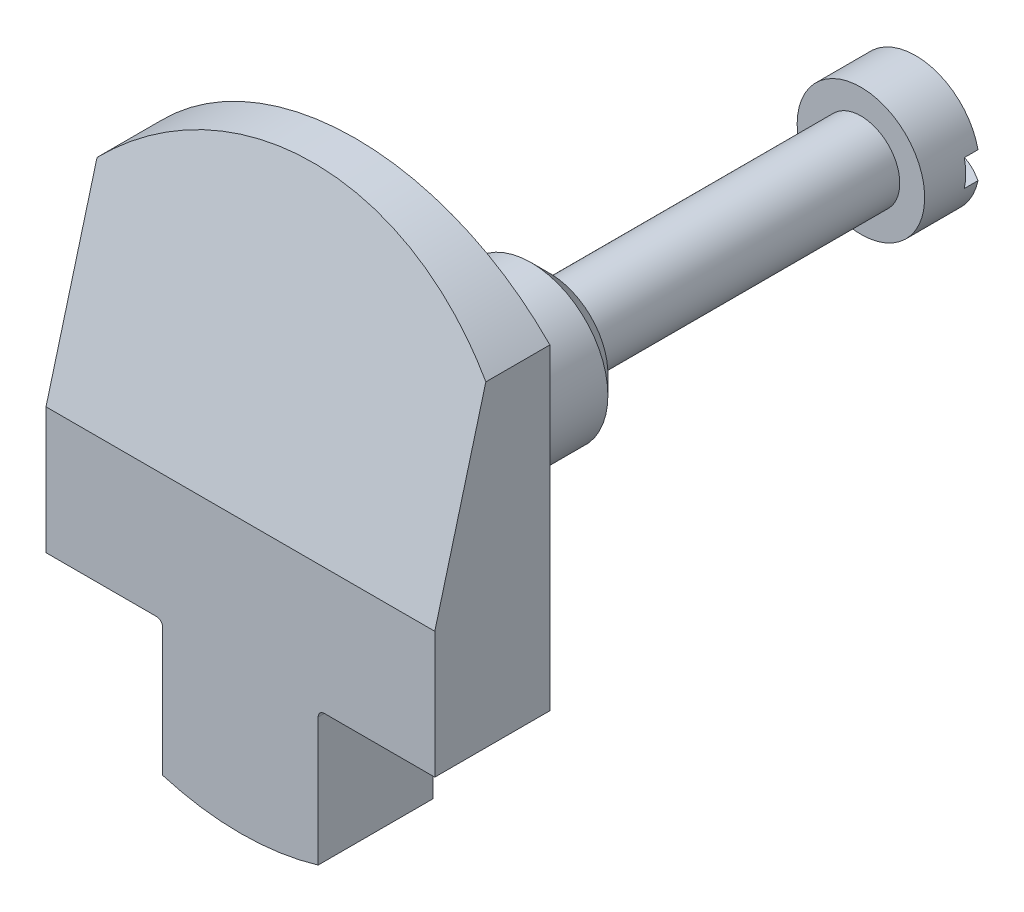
ISO-10303-21;
HEADER;
FILE_DESCRIPTION(('STEP AP214'),'2;1');
FILE_NAME('part.step','',(''),(''),'','','');
FILE_SCHEMA(('AUTOMOTIVE_DESIGN { 1 0 10303 214 1 1 1 1 }'));
ENDSEC;
DATA;
#1=APPLICATION_CONTEXT('core data for automotive mechanical design processes');
#2=APPLICATION_PROTOCOL_DEFINITION('international standard','automotive_design',2000,#1);
#3=PRODUCT_CONTEXT('',#1,'mechanical');
#4=PRODUCT('Part','Part','',(#3));
#5=PRODUCT_RELATED_PRODUCT_CATEGORY('part','',(#4));
#6=PRODUCT_DEFINITION_FORMATION('','',#4);
#7=PRODUCT_DEFINITION_CONTEXT('part definition',#1,'design');
#8=PRODUCT_DEFINITION('design','',#6,#7);
#9=PRODUCT_DEFINITION_SHAPE('','',#8);
#10=(LENGTH_UNIT() NAMED_UNIT(*) SI_UNIT(.MILLI.,.METRE.));
#11=(NAMED_UNIT(*) PLANE_ANGLE_UNIT() SI_UNIT($,.RADIAN.));
#12=(NAMED_UNIT(*) SI_UNIT($,.STERADIAN.) SOLID_ANGLE_UNIT());
#13=UNCERTAINTY_MEASURE_WITH_UNIT(LENGTH_MEASURE(1.E-05),#10,'distance_accuracy_value','');
#14=(GEOMETRIC_REPRESENTATION_CONTEXT(3) GLOBAL_UNCERTAINTY_ASSIGNED_CONTEXT((#13)) GLOBAL_UNIT_ASSIGNED_CONTEXT((#10,
#11,#12)) REPRESENTATION_CONTEXT('',''));
#15=CARTESIAN_POINT('',(0.,0.,0.));
#16=DIRECTION('',(0.,0.,1.));
#17=DIRECTION('',(1.,0.,0.));
#18=AXIS2_PLACEMENT_3D('',#15,#16,#17);
#19=CARTESIAN_POINT('',(0.,0.,0.));
#20=DIRECTION('',(0.,0.,1.));
#21=DIRECTION('',(1.,0.,0.));
#22=AXIS2_PLACEMENT_3D('',#19,#20,#21);
#23=PLANE('',#22);
#24=CARTESIAN_POINT('',(0.,0.,0.));
#25=DIRECTION('',(0.,0.,1.));
#26=DIRECTION('',(1.,0.,0.));
#27=AXIS2_PLACEMENT_3D('',#24,#25,#26);
#28=CIRCLE('',#27,3.38455);
#29=CARTESIAN_POINT('',(3.38455,0.,0.));
#30=VERTEX_POINT('',#29);
#31=EDGE_CURVE('E162',#30,#30,#28,.T.);
#32=ORIENTED_EDGE('',*,*,#31,.T.);
#33=EDGE_LOOP('',(#32));
#34=FACE_BOUND('',#33,.T.);
#35=CARTESIAN_POINT('',(0.,0.,0.));
#36=DIRECTION('',(0.,0.,1.));
#37=DIRECTION('',(1.,0.,0.));
#38=AXIS2_PLACEMENT_3D('',#35,#36,#37);
#39=CIRCLE('',#38,11.1125);
#40=CARTESIAN_POINT('',(-3.175,-10.6492737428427,0.));
#41=VERTEX_POINT('',#40);
#42=CARTESIAN_POINT('',(3.175,-10.6492737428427,0.));
#43=VERTEX_POINT('',#42);
#44=EDGE_CURVE('E497',#41,#43,#39,.T.);
#45=ORIENTED_EDGE('',*,*,#44,.F.);
#46=DIRECTION('',(0.,-1.,0.));
#47=VECTOR('',#46,1.);
#48=CARTESIAN_POINT('',(-3.175,-5.159375,0.));
#49=LINE('',#48,#47);
#50=CARTESIAN_POINT('',(-3.175,-5.413375,0.));
#51=VERTEX_POINT('',#50);
#52=EDGE_CURVE('E489',#51,#41,#49,.T.);
#53=ORIENTED_EDGE('',*,*,#52,.F.);
#54=CARTESIAN_POINT('',(-3.429,-5.413375,0.));
#55=DIRECTION('',(0.,0.,1.));
#56=DIRECTION('',(1.,0.,0.));
#57=AXIS2_PLACEMENT_3D('',#54,#55,#56);
#58=CIRCLE('',#57,0.254);
#59=CARTESIAN_POINT('',(-3.429,-5.159375,0.));
#60=VERTEX_POINT('',#59);
#61=EDGE_CURVE('E165',#51,#60,#58,.T.);
#62=ORIENTED_EDGE('',*,*,#61,.T.);
#63=DIRECTION('',(1.,0.,0.));
#64=VECTOR('',#63,1.);
#65=CARTESIAN_POINT('',(-3.175,-5.159375,0.));
#66=LINE('',#65,#64);
#67=CARTESIAN_POINT('',(-7.9375,-5.159375,0.));
#68=VERTEX_POINT('',#67);
#69=EDGE_CURVE('E499',#68,#60,#66,.T.);
#70=ORIENTED_EDGE('',*,*,#69,.F.);
#71=DIRECTION('',(0.,-1.,0.));
#72=VECTOR('',#71,1.);
#73=CARTESIAN_POINT('',(-7.9375,-5.159375,0.));
#74=LINE('',#73,#72);
#75=CARTESIAN_POINT('',(-7.9375,7.77712993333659,0.));
#76=VERTEX_POINT('',#75);
#77=EDGE_CURVE('E502',#76,#68,#74,.T.);
#78=ORIENTED_EDGE('',*,*,#77,.F.);
#79=CARTESIAN_POINT('',(0.,0.,0.));
#80=DIRECTION('',(0.,0.,1.));
#81=DIRECTION('',(1.,0.,0.));
#82=AXIS2_PLACEMENT_3D('',#79,#80,#81);
#83=CIRCLE('',#82,11.1125);
#84=CARTESIAN_POINT('',(7.9375,7.77712993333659,0.));
#85=VERTEX_POINT('',#84);
#86=EDGE_CURVE('E464',#85,#76,#83,.T.);
#87=ORIENTED_EDGE('',*,*,#86,.F.);
#88=DIRECTION('',(0.,1.,0.));
#89=VECTOR('',#88,1.);
#90=CARTESIAN_POINT('',(7.9375,-5.159375,0.));
#91=LINE('',#90,#89);
#92=CARTESIAN_POINT('',(7.9375,-5.159375,0.));
#93=VERTEX_POINT('',#92);
#94=EDGE_CURVE('E517',#93,#85,#91,.T.);
#95=ORIENTED_EDGE('',*,*,#94,.F.);
#96=DIRECTION('',(1.,0.,0.));
#97=VECTOR('',#96,1.);
#98=CARTESIAN_POINT('',(7.9375,-5.159375,0.));
#99=LINE('',#98,#97);
#100=CARTESIAN_POINT('',(3.429,-5.159375,0.));
#101=VERTEX_POINT('',#100);
#102=EDGE_CURVE('E522',#101,#93,#99,.T.);
#103=ORIENTED_EDGE('',*,*,#102,.F.);
#104=CARTESIAN_POINT('',(3.429,-5.413375,0.));
#105=DIRECTION('',(0.,0.,1.));
#106=DIRECTION('',(1.,0.,0.));
#107=AXIS2_PLACEMENT_3D('',#104,#105,#106);
#108=CIRCLE('',#107,0.254);
#109=CARTESIAN_POINT('',(3.175,-5.413375,0.));
#110=VERTEX_POINT('',#109);
#111=EDGE_CURVE('E139',#101,#110,#108,.T.);
#112=ORIENTED_EDGE('',*,*,#111,.T.);
#113=DIRECTION('',(0.,1.,0.));
#114=VECTOR('',#113,1.);
#115=CARTESIAN_POINT('',(3.175,-5.159375,0.));
#116=LINE('',#115,#114);
#117=EDGE_CURVE('E524',#43,#110,#116,.T.);
#118=ORIENTED_EDGE('',*,*,#117,.F.);
#119=EDGE_LOOP('',(#45,#53,#62,#70,#78,#87,#95,#103,#112,#118));
#120=FACE_BOUND('',#119,.T.);
#121=ADVANCED_FACE('F14',(#34,#120),#23,.F.);
#122=CARTESIAN_POINT('',(0.,0.,4.699));
#123=DIRECTION('',(0.,0.,-1.));
#124=DIRECTION('',(-1.,0.,0.));
#125=AXIS2_PLACEMENT_3D('',#122,#123,#124);
#126=CYLINDRICAL_SURFACE('',#125,11.1125);
#127=ORIENTED_EDGE('',*,*,#44,.T.);
#128=DIRECTION('',(0.,0.,-1.));
#129=VECTOR('',#128,1.);
#130=CARTESIAN_POINT('',(3.175,-10.6492737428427,4.699));
#131=LINE('',#130,#129);
#132=CARTESIAN_POINT('',(3.175,-10.6492737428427,4.699));
#133=VERTEX_POINT('',#132);
#134=EDGE_CURVE('E476',#133,#43,#131,.T.);
#135=ORIENTED_EDGE('',*,*,#134,.F.);
#136=CARTESIAN_POINT('',(0.,0.,4.699));
#137=DIRECTION('',(0.,0.,1.));
#138=DIRECTION('',(1.,0.,0.));
#139=AXIS2_PLACEMENT_3D('',#136,#137,#138);
#140=CIRCLE('',#139,11.1125);
#141=CARTESIAN_POINT('',(-3.175,-10.6492737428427,4.699));
#142=VERTEX_POINT('',#141);
#143=EDGE_CURVE('E498',#142,#133,#140,.T.);
#144=ORIENTED_EDGE('',*,*,#143,.F.);
#145=DIRECTION('',(0.,0.,-1.));
#146=VECTOR('',#145,1.);
#147=CARTESIAN_POINT('',(-3.175,-10.6492737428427,4.699));
#148=LINE('',#147,#146);
#149=EDGE_CURVE('E471',#142,#41,#148,.T.);
#150=ORIENTED_EDGE('',*,*,#149,.T.);
#151=EDGE_LOOP('',(#127,#135,#144,#150));
#152=FACE_BOUND('',#151,.T.);
#153=ADVANCED_FACE('F225',(#152),#126,.T.);
#154=CARTESIAN_POINT('',(3.175,-5.159375,4.699));
#155=DIRECTION('',(-1.,0.,0.));
#156=DIRECTION('',(0.,-1.,0.));
#157=AXIS2_PLACEMENT_3D('',#154,#155,#156);
#158=PLANE('',#157);
#159=ORIENTED_EDGE('',*,*,#117,.T.);
#160=DIRECTION('',(0.,0.,-1.));
#161=VECTOR('',#160,1.);
#162=CARTESIAN_POINT('',(3.175,-5.413375,4.699));
#163=LINE('',#162,#161);
#164=CARTESIAN_POINT('',(3.175,-5.413375,4.699));
#165=VERTEX_POINT('',#164);
#166=EDGE_CURVE('E33',#110,#165,#163,.F.);
#167=ORIENTED_EDGE('',*,*,#166,.T.);
#168=DIRECTION('',(0.,1.,0.));
#169=VECTOR('',#168,1.);
#170=CARTESIAN_POINT('',(3.175,-5.159375,4.699));
#171=LINE('',#170,#169);
#172=EDGE_CURVE('E136',#133,#165,#171,.T.);
#173=ORIENTED_EDGE('',*,*,#172,.F.);
#174=ORIENTED_EDGE('',*,*,#134,.T.);
#175=EDGE_LOOP('',(#159,#167,#173,#174));
#176=FACE_BOUND('',#175,.T.);
#177=ADVANCED_FACE('F232',(#176),#158,.F.);
#178=CARTESIAN_POINT('',(7.9375,-5.159375,4.699));
#179=DIRECTION('',(0.,1.,0.));
#180=DIRECTION('',(0.,0.,1.));
#181=AXIS2_PLACEMENT_3D('',#178,#179,#180);
#182=PLANE('',#181);
#183=DIRECTION('',(1.,0.,0.));
#184=VECTOR('',#183,1.);
#185=CARTESIAN_POINT('',(7.9375,-5.159375,4.699));
#186=LINE('',#185,#184);
#187=CARTESIAN_POINT('',(3.429,-5.159375,4.699));
#188=VERTEX_POINT('',#187);
#189=CARTESIAN_POINT('',(7.9375,-5.159375,4.699));
#190=VERTEX_POINT('',#189);
#191=EDGE_CURVE('E133',#188,#190,#186,.T.);
#192=ORIENTED_EDGE('',*,*,#191,.F.);
#193=DIRECTION('',(0.,0.,-1.));
#194=VECTOR('',#193,1.);
#195=CARTESIAN_POINT('',(3.429,-5.159375,0.));
#196=LINE('',#195,#194);
#197=EDGE_CURVE('E144',#188,#101,#196,.T.);
#198=ORIENTED_EDGE('',*,*,#197,.T.);
#199=ORIENTED_EDGE('',*,*,#102,.T.);
#200=DIRECTION('',(0.,0.,-1.));
#201=VECTOR('',#200,1.);
#202=CARTESIAN_POINT('',(7.9375,-5.159375,4.699));
#203=LINE('',#202,#201);
#204=EDGE_CURVE('E147',#190,#93,#203,.T.);
#205=ORIENTED_EDGE('',*,*,#204,.F.);
#206=EDGE_LOOP('',(#192,#198,#199,#205));
#207=FACE_BOUND('',#206,.T.);
#208=ADVANCED_FACE('F143',(#207),#182,.F.);
#209=CARTESIAN_POINT('',(7.9375,-5.159375,4.699));
#210=DIRECTION('',(-1.,0.,0.));
#211=DIRECTION('',(0.,-1.,0.));
#212=AXIS2_PLACEMENT_3D('',#209,#210,#211);
#213=PLANE('',#212);
#214=DIRECTION('',(0.,0.,-1.));
#215=VECTOR('',#214,1.);
#216=CARTESIAN_POINT('',(7.9375,7.77712993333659,4.699));
#217=LINE('',#216,#215);
#218=CARTESIAN_POINT('',(7.9375,7.77712993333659,2.61512431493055));
#219=VERTEX_POINT('',#218);
#220=EDGE_CURVE('E466',#219,#85,#217,.T.);
#221=ORIENTED_EDGE('',*,*,#220,.F.);
#222=DIRECTION('',(0.,-0.965925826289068,0.258819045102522));
#223=VECTOR('',#222,1.);
#224=CARTESIAN_POINT('',(7.9375,-4.81376240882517,5.98884375));
#225=LINE('',#224,#223);
#226=CARTESIAN_POINT('',(7.9375,0.,4.699));
#227=VERTEX_POINT('',#226);
#228=EDGE_CURVE('E453',#219,#227,#225,.T.);
#229=ORIENTED_EDGE('',*,*,#228,.T.);
#230=DIRECTION('',(0.,1.,0.));
#231=VECTOR('',#230,1.);
#232=CARTESIAN_POINT('',(7.9375,-5.159375,4.699));
#233=LINE('',#232,#231);
#234=EDGE_CURVE('E149',#190,#227,#233,.T.);
#235=ORIENTED_EDGE('',*,*,#234,.F.);
#236=ORIENTED_EDGE('',*,*,#204,.T.);
#237=ORIENTED_EDGE('',*,*,#94,.T.);
#238=EDGE_LOOP('',(#221,#229,#235,#236,#237));
#239=FACE_BOUND('',#238,.T.);
#240=ADVANCED_FACE('F257',(#239),#213,.F.);
#241=CARTESIAN_POINT('',(0.,0.,4.699));
#242=DIRECTION('',(0.,0.,-1.));
#243=DIRECTION('',(-1.,0.,0.));
#244=AXIS2_PLACEMENT_3D('',#241,#242,#243);
#245=CYLINDRICAL_SURFACE('',#244,11.1125);
#246=DIRECTION('',(0.,0.,-1.));
#247=VECTOR('',#246,1.);
#248=CARTESIAN_POINT('',(-7.9375,7.77712993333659,4.699));
#249=LINE('',#248,#247);
#250=CARTESIAN_POINT('',(-7.9375,7.77712993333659,2.61512431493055));
#251=VERTEX_POINT('',#250);
#252=EDGE_CURVE('E458',#251,#76,#249,.T.);
#253=ORIENTED_EDGE('',*,*,#252,.F.);
#254=CARTESIAN_POINT('',(0.,0.,4.699));
#255=DIRECTION('',(0.,-0.258819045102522,-0.965925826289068));
#256=DIRECTION('',(0.,0.965925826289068,-0.258819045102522));
#257=AXIS2_PLACEMENT_3D('',#254,#255,#256);
#258=ELLIPSE('',#257,11.504506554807,11.1125);
#259=EDGE_CURVE('E451',#251,#219,#258,.T.);
#260=ORIENTED_EDGE('',*,*,#259,.T.);
#261=ORIENTED_EDGE('',*,*,#220,.T.);
#262=ORIENTED_EDGE('',*,*,#86,.T.);
#263=EDGE_LOOP('',(#253,#260,#261,#262));
#264=FACE_BOUND('',#263,.T.);
#265=ADVANCED_FACE('F253',(#264),#245,.T.);
#266=CARTESIAN_POINT('',(-7.9375,-5.159375,4.699));
#267=DIRECTION('',(1.,0.,0.));
#268=DIRECTION('',(0.,1.,0.));
#269=AXIS2_PLACEMENT_3D('',#266,#267,#268);
#270=PLANE('',#269);
#271=DIRECTION('',(0.,-1.,0.));
#272=VECTOR('',#271,1.);
#273=CARTESIAN_POINT('',(-7.9375,-5.159375,4.699));
#274=LINE('',#273,#272);
#275=CARTESIAN_POINT('',(-7.9375,0.,4.699));
#276=VERTEX_POINT('',#275);
#277=CARTESIAN_POINT('',(-7.9375,-5.159375,4.699));
#278=VERTEX_POINT('',#277);
#279=EDGE_CURVE('E461',#276,#278,#274,.T.);
#280=ORIENTED_EDGE('',*,*,#279,.F.);
#281=DIRECTION('',(0.,0.965925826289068,-0.258819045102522));
#282=VECTOR('',#281,1.);
#283=CARTESIAN_POINT('',(-7.9375,-4.81376240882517,5.98884375));
#284=LINE('',#283,#282);
#285=EDGE_CURVE('E200',#276,#251,#284,.T.);
#286=ORIENTED_EDGE('',*,*,#285,.T.);
#287=ORIENTED_EDGE('',*,*,#252,.T.);
#288=ORIENTED_EDGE('',*,*,#77,.T.);
#289=DIRECTION('',(0.,0.,-1.));
#290=VECTOR('',#289,1.);
#291=CARTESIAN_POINT('',(-7.9375,-5.159375,4.699));
#292=LINE('',#291,#290);
#293=EDGE_CURVE('E467',#278,#68,#292,.T.);
#294=ORIENTED_EDGE('',*,*,#293,.F.);
#295=EDGE_LOOP('',(#280,#286,#287,#288,#294));
#296=FACE_BOUND('',#295,.T.);
#297=ADVANCED_FACE('F249',(#296),#270,.F.);
#298=CARTESIAN_POINT('',(-3.175,-5.159375,4.699));
#299=DIRECTION('',(0.,1.,0.));
#300=DIRECTION('',(0.,0.,1.));
#301=AXIS2_PLACEMENT_3D('',#298,#299,#300);
#302=PLANE('',#301);
#303=ORIENTED_EDGE('',*,*,#69,.T.);
#304=DIRECTION('',(0.,0.,-1.));
#305=VECTOR('',#304,1.);
#306=CARTESIAN_POINT('',(-3.429,-5.159375,4.699));
#307=LINE('',#306,#305);
#308=CARTESIAN_POINT('',(-3.429,-5.159375,4.699));
#309=VERTEX_POINT('',#308);
#310=EDGE_CURVE('E152',#60,#309,#307,.F.);
#311=ORIENTED_EDGE('',*,*,#310,.T.);
#312=DIRECTION('',(1.,0.,0.));
#313=VECTOR('',#312,1.);
#314=CARTESIAN_POINT('',(-3.175,-5.159375,4.699));
#315=LINE('',#314,#313);
#316=EDGE_CURVE('E509',#278,#309,#315,.T.);
#317=ORIENTED_EDGE('',*,*,#316,.F.);
#318=ORIENTED_EDGE('',*,*,#293,.T.);
#319=EDGE_LOOP('',(#303,#311,#317,#318));
#320=FACE_BOUND('',#319,.T.);
#321=ADVANCED_FACE('F245',(#320),#302,.F.);
#322=CARTESIAN_POINT('',(-3.175,-5.159375,4.699));
#323=DIRECTION('',(1.,0.,0.));
#324=DIRECTION('',(0.,1.,0.));
#325=AXIS2_PLACEMENT_3D('',#322,#323,#324);
#326=PLANE('',#325);
#327=DIRECTION('',(0.,-1.,0.));
#328=VECTOR('',#327,1.);
#329=CARTESIAN_POINT('',(-3.175,-5.159375,4.699));
#330=LINE('',#329,#328);
#331=CARTESIAN_POINT('',(-3.175,-5.413375,4.699));
#332=VERTEX_POINT('',#331);
#333=EDGE_CURVE('E491',#332,#142,#330,.T.);
#334=ORIENTED_EDGE('',*,*,#333,.F.);
#335=DIRECTION('',(0.,0.,-1.));
#336=VECTOR('',#335,1.);
#337=CARTESIAN_POINT('',(-3.175,-5.413375,0.));
#338=LINE('',#337,#336);
#339=EDGE_CURVE('E156',#332,#51,#338,.T.);
#340=ORIENTED_EDGE('',*,*,#339,.T.);
#341=ORIENTED_EDGE('',*,*,#52,.T.);
#342=ORIENTED_EDGE('',*,*,#149,.F.);
#343=EDGE_LOOP('',(#334,#340,#341,#342));
#344=FACE_BOUND('',#343,.T.);
#345=ADVANCED_FACE('F242',(#344),#326,.F.);
#346=CARTESIAN_POINT('',(0.,0.,4.699));
#347=DIRECTION('',(0.,0.,1.));
#348=DIRECTION('',(1.,0.,0.));
#349=AXIS2_PLACEMENT_3D('',#346,#347,#348);
#350=PLANE('',#349);
#351=DIRECTION('',(1.,0.,0.));
#352=VECTOR('',#351,1.);
#353=CARTESIAN_POINT('',(0.,0.,4.699));
#354=LINE('',#353,#352);
#355=EDGE_CURVE('E75',#276,#227,#354,.T.);
#356=ORIENTED_EDGE('',*,*,#355,.F.);
#357=ORIENTED_EDGE('',*,*,#279,.T.);
#358=ORIENTED_EDGE('',*,*,#316,.T.);
#359=CARTESIAN_POINT('',(-3.429,-5.413375,4.699));
#360=DIRECTION('',(0.,0.,1.));
#361=DIRECTION('',(1.,0.,0.));
#362=AXIS2_PLACEMENT_3D('',#359,#360,#361);
#363=CIRCLE('',#362,0.254);
#364=EDGE_CURVE('E167',#309,#332,#363,.F.);
#365=ORIENTED_EDGE('',*,*,#364,.T.);
#366=ORIENTED_EDGE('',*,*,#333,.T.);
#367=ORIENTED_EDGE('',*,*,#143,.T.);
#368=ORIENTED_EDGE('',*,*,#172,.T.);
#369=CARTESIAN_POINT('',(3.429,-5.413375,4.699));
#370=DIRECTION('',(0.,0.,1.));
#371=DIRECTION('',(1.,0.,0.));
#372=AXIS2_PLACEMENT_3D('',#369,#370,#371);
#373=CIRCLE('',#372,0.254);
#374=EDGE_CURVE('E24',#165,#188,#373,.F.);
#375=ORIENTED_EDGE('',*,*,#374,.T.);
#376=ORIENTED_EDGE('',*,*,#191,.T.);
#377=ORIENTED_EDGE('',*,*,#234,.T.);
#378=EDGE_LOOP('',(#356,#357,#358,#365,#366,#367,#368,#375,#376,#377));
#379=FACE_BOUND('',#378,.T.);
#380=ADVANCED_FACE('F131',(#379),#350,.T.);
#381=CARTESIAN_POINT('',(-12.7,0.,4.699));
#382=DIRECTION('',(0.,-0.258819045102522,-0.965925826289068));
#383=DIRECTION('',(0.,0.965925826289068,-0.258819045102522));
#384=AXIS2_PLACEMENT_3D('',#381,#382,#383);
#385=PLANE('',#384);
#386=ORIENTED_EDGE('',*,*,#259,.F.);
#387=ORIENTED_EDGE('',*,*,#285,.F.);
#388=ORIENTED_EDGE('',*,*,#355,.T.);
#389=ORIENTED_EDGE('',*,*,#228,.F.);
#390=EDGE_LOOP('',(#386,#387,#388,#389));
#391=FACE_BOUND('',#390,.T.);
#392=ADVANCED_FACE('F238',(#391),#385,.F.);
#393=CARTESIAN_POINT('',(0.,0.,-7.9375));
#394=DIRECTION('',(0.,0.,1.));
#395=DIRECTION('',(1.,0.,0.));
#396=AXIS2_PLACEMENT_3D('',#393,#394,#395);
#397=CYLINDRICAL_SURFACE('',#396,3.13055);
#398=CARTESIAN_POINT('',(0.,0.,-0.254));
#399=DIRECTION('',(0.,0.,1.));
#400=DIRECTION('',(1.,0.,0.));
#401=AXIS2_PLACEMENT_3D('',#398,#399,#400);
#402=CIRCLE('',#401,3.13055);
#403=CARTESIAN_POINT('',(3.13055,0.,-0.254));
#404=VERTEX_POINT('',#403);
#405=EDGE_CURVE('E154',#404,#404,#402,.F.);
#406=ORIENTED_EDGE('',*,*,#405,.T.);
#407=EDGE_LOOP('',(#406));
#408=FACE_BOUND('',#407,.T.);
#409=CARTESIAN_POINT('',(0.,0.,-7.1755));
#410=DIRECTION('',(0.,0.,-1.));
#411=DIRECTION('',(-1.,0.,0.));
#412=AXIS2_PLACEMENT_3D('',#409,#410,#411);
#413=CIRCLE('',#412,3.13055);
#414=CARTESIAN_POINT('',(-3.13055,0.,-7.1755));
#415=VERTEX_POINT('',#414);
#416=EDGE_CURVE('E482',#415,#415,#413,.F.);
#417=ORIENTED_EDGE('',*,*,#416,.T.);
#418=EDGE_LOOP('',(#417));
#419=FACE_BOUND('',#418,.T.);
#420=ADVANCED_FACE('F294',(#408,#419),#397,.T.);
#421=CARTESIAN_POINT('',(0.,0.,-7.9375));
#422=DIRECTION('',(0.,0.,-1.));
#423=DIRECTION('',(-1.,0.,0.));
#424=AXIS2_PLACEMENT_3D('',#421,#422,#423);
#425=PLANE('',#424);
#426=CARTESIAN_POINT('',(0.,0.,-7.9375));
#427=DIRECTION('',(0.,0.,-1.));
#428=DIRECTION('',(-1.,0.,0.));
#429=AXIS2_PLACEMENT_3D('',#426,#427,#428);
#430=CIRCLE('',#429,2.36855);
#431=CARTESIAN_POINT('',(-2.36855,0.,-7.9375));
#432=VERTEX_POINT('',#431);
#433=EDGE_CURVE('E480',#432,#432,#430,.T.);
#434=ORIENTED_EDGE('',*,*,#433,.T.);
#435=EDGE_LOOP('',(#434));
#436=FACE_BOUND('',#435,.T.);
#437=CARTESIAN_POINT('',(0.,0.,-7.9375));
#438=DIRECTION('',(0.,0.,-1.));
#439=DIRECTION('',(-1.,0.,0.));
#440=AXIS2_PLACEMENT_3D('',#437,#438,#439);
#441=CIRCLE('',#440,1.5875);
#442=CARTESIAN_POINT('',(-1.5875,0.,-7.9375));
#443=VERTEX_POINT('',#442);
#444=EDGE_CURVE('E9',#443,#443,#441,.F.);
#445=ORIENTED_EDGE('',*,*,#444,.T.);
#446=EDGE_LOOP('',(#445));
#447=FACE_BOUND('',#446,.T.);
#448=ADVANCED_FACE('F291',(#436,#447),#425,.T.);
#449=CARTESIAN_POINT('',(0.,0.,-7.9375));
#450=DIRECTION('',(0.,0.,1.));
#451=DIRECTION('',(1.,0.,0.));
#452=AXIS2_PLACEMENT_3D('',#449,#450,#451);
#453=CONICAL_SURFACE('',#452,2.36855,0.785398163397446);
#454=ORIENTED_EDGE('',*,*,#416,.F.);
#455=EDGE_LOOP('',(#454));
#456=FACE_BOUND('',#455,.T.);
#457=ORIENTED_EDGE('',*,*,#433,.F.);
#458=EDGE_LOOP('',(#457));
#459=FACE_BOUND('',#458,.T.);
#460=ADVANCED_FACE('F293',(#456,#459),#453,.T.);
#461=CARTESIAN_POINT('',(-3.429,-5.413375,4.699));
#462=DIRECTION('',(0.,0.,1.));
#463=DIRECTION('',(1.,0.,0.));
#464=AXIS2_PLACEMENT_3D('',#461,#462,#463);
#465=CYLINDRICAL_SURFACE('',#464,0.254);
#466=ORIENTED_EDGE('',*,*,#364,.F.);
#467=ORIENTED_EDGE('',*,*,#310,.F.);
#468=ORIENTED_EDGE('',*,*,#61,.F.);
#469=ORIENTED_EDGE('',*,*,#339,.F.);
#470=EDGE_LOOP('',(#466,#467,#468,#469));
#471=FACE_BOUND('',#470,.T.);
#472=ADVANCED_FACE('F302',(#471),#465,.F.);
#473=CARTESIAN_POINT('',(3.429,-5.413375,4.699));
#474=DIRECTION('',(0.,0.,1.));
#475=DIRECTION('',(1.,0.,0.));
#476=AXIS2_PLACEMENT_3D('',#473,#474,#475);
#477=CYLINDRICAL_SURFACE('',#476,0.254);
#478=ORIENTED_EDGE('',*,*,#374,.F.);
#479=ORIENTED_EDGE('',*,*,#166,.F.);
#480=ORIENTED_EDGE('',*,*,#111,.F.);
#481=ORIENTED_EDGE('',*,*,#197,.F.);
#482=EDGE_LOOP('',(#478,#479,#480,#481));
#483=FACE_BOUND('',#482,.T.);
#484=ADVANCED_FACE('F151',(#483),#477,.F.);
#485=CARTESIAN_POINT('',(0.,0.,-0.254));
#486=DIRECTION('',(0.,0.,1.));
#487=DIRECTION('',(1.,0.,0.));
#488=AXIS2_PLACEMENT_3D('',#485,#486,#487);
#489=TOROIDAL_SURFACE('',#488,3.38455,0.254);
#490=ORIENTED_EDGE('',*,*,#31,.F.);
#491=EDGE_LOOP('',(#490));
#492=FACE_BOUND('',#491,.T.);
#493=ORIENTED_EDGE('',*,*,#405,.F.);
#494=EDGE_LOOP('',(#493));
#495=FACE_BOUND('',#494,.T.);
#496=ADVANCED_FACE('F212',(#492,#495),#489,.F.);
#497=CARTESIAN_POINT('',(0.,0.,-19.10943203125));
#498=DIRECTION('',(0.,0.,-1.));
#499=DIRECTION('',(0.,1.,0.));
#500=AXIS2_PLACEMENT_3D('',#497,#498,#499);
#501=SPHERICAL_SURFACE('',#500,4.57606796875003);
#502=CARTESIAN_POINT('',(0.,0.,-22.8727));
#503=DIRECTION('',(0.,0.,-1.));
#504=DIRECTION('',(-1.,0.,0.));
#505=AXIS2_PLACEMENT_3D('',#502,#503,#504);
#506=CIRCLE('',#505,2.6035);
#507=CARTESIAN_POINT('',(2.54558186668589,-0.5461,-22.8727));
#508=VERTEX_POINT('',#507);
#509=CARTESIAN_POINT('',(-2.54558186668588,-0.5461,-22.8727));
#510=VERTEX_POINT('',#509);
#511=EDGE_CURVE('E185',#508,#510,#506,.T.);
#512=ORIENTED_EDGE('',*,*,#511,.T.);
#513=CARTESIAN_POINT('',(0.,-0.5461,-19.10943203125));
#514=DIRECTION('',(0.,1.,0.));
#515=DIRECTION('',(-1.,0.,0.));
#516=AXIS2_PLACEMENT_3D('',#513,#514,#515);
#517=CIRCLE('',#516,4.54336580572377);
#518=EDGE_CURVE('E177',#510,#508,#517,.F.);
#519=ORIENTED_EDGE('',*,*,#518,.T.);
#520=EDGE_LOOP('',(#512,#519));
#521=FACE_BOUND('',#520,.T.);
#522=ADVANCED_FACE('F209',(#521),#501,.T.);
#523=CARTESIAN_POINT('',(-2.54558186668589,0.5461,-22.8727));
#524=VERTEX_POINT('',#523);
#525=CARTESIAN_POINT('',(2.54558186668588,0.5461,-22.8727));
#526=VERTEX_POINT('',#525);
#527=EDGE_CURVE('E188',#524,#526,#506,.T.);
#528=ORIENTED_EDGE('',*,*,#527,.T.);
#529=CARTESIAN_POINT('',(0.,0.5461,-19.10943203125));
#530=DIRECTION('',(0.,-1.,0.));
#531=DIRECTION('',(1.,0.,0.));
#532=AXIS2_PLACEMENT_3D('',#529,#530,#531);
#533=CIRCLE('',#532,4.54336580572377);
#534=EDGE_CURVE('E174',#526,#524,#533,.F.);
#535=ORIENTED_EDGE('',*,*,#534,.T.);
#536=EDGE_LOOP('',(#528,#535));
#537=FACE_BOUND('',#536,.T.);
#538=ADVANCED_FACE('F211',(#537),#501,.T.);
#539=CARTESIAN_POINT('',(-2.6035,0.5461,-22.3139));
#540=DIRECTION('',(0.,-1.,0.));
#541=DIRECTION('',(1.,0.,0.));
#542=AXIS2_PLACEMENT_3D('',#539,#540,#541);
#543=PLANE('',#542);
#544=DIRECTION('',(0.,0.,-1.));
#545=VECTOR('',#544,1.);
#546=CARTESIAN_POINT('',(-2.54558186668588,0.5461,-49.0855));
#547=LINE('',#546,#545);
#548=CARTESIAN_POINT('',(-2.54558186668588,0.5461,-22.3139));
#549=VERTEX_POINT('',#548);
#550=EDGE_CURVE('E191',#549,#524,#547,.T.);
#551=ORIENTED_EDGE('',*,*,#550,.T.);
#552=ORIENTED_EDGE('',*,*,#534,.F.);
#553=DIRECTION('',(0.,0.,-1.));
#554=VECTOR('',#553,1.);
#555=CARTESIAN_POINT('',(2.54558186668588,0.5461,-49.0855));
#556=LINE('',#555,#554);
#557=CARTESIAN_POINT('',(2.54558186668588,0.5461,-22.3139));
#558=VERTEX_POINT('',#557);
#559=EDGE_CURVE('E195',#526,#558,#556,.F.);
#560=ORIENTED_EDGE('',*,*,#559,.T.);
#561=DIRECTION('',(-1.,0.,0.));
#562=VECTOR('',#561,1.);
#563=CARTESIAN_POINT('',(-2.6035,0.5461,-22.3139));
#564=LINE('',#563,#562);
#565=EDGE_CURVE('E171',#558,#549,#564,.T.);
#566=ORIENTED_EDGE('',*,*,#565,.T.);
#567=EDGE_LOOP('',(#551,#552,#560,#566));
#568=FACE_BOUND('',#567,.T.);
#569=ADVANCED_FACE('F219',(#568),#543,.T.);
#570=CARTESIAN_POINT('',(-2.6035,-0.5461,-22.3139));
#571=DIRECTION('',(0.,0.,-1.));
#572=DIRECTION('',(-1.,0.,0.));
#573=AXIS2_PLACEMENT_3D('',#570,#571,#572);
#574=PLANE('',#573);
#575=ORIENTED_EDGE('',*,*,#565,.F.);
#576=CARTESIAN_POINT('',(0.,0.,-22.3139));
#577=DIRECTION('',(0.,0.,-1.));
#578=DIRECTION('',(-1.,0.,0.));
#579=AXIS2_PLACEMENT_3D('',#576,#577,#578);
#580=CIRCLE('',#579,2.6035);
#581=CARTESIAN_POINT('',(2.54558186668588,-0.5461,-22.3139));
#582=VERTEX_POINT('',#581);
#583=EDGE_CURVE('E192',#558,#582,#580,.T.);
#584=ORIENTED_EDGE('',*,*,#583,.T.);
#585=DIRECTION('',(1.,0.,0.));
#586=VECTOR('',#585,1.);
#587=CARTESIAN_POINT('',(2.6035,-0.5461,-22.3139));
#588=LINE('',#587,#586);
#589=CARTESIAN_POINT('',(-2.54558186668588,-0.5461,-22.3139));
#590=VERTEX_POINT('',#589);
#591=EDGE_CURVE('E66',#590,#582,#588,.T.);
#592=ORIENTED_EDGE('',*,*,#591,.F.);
#593=EDGE_CURVE('E189',#590,#549,#580,.T.);
#594=ORIENTED_EDGE('',*,*,#593,.T.);
#595=EDGE_LOOP('',(#575,#584,#592,#594));
#596=FACE_BOUND('',#595,.T.);
#597=ADVANCED_FACE('F201',(#596),#574,.T.);
#598=CARTESIAN_POINT('',(2.6035,-0.5461,-22.3139));
#599=DIRECTION('',(0.,1.,0.));
#600=DIRECTION('',(-1.,0.,0.));
#601=AXIS2_PLACEMENT_3D('',#598,#599,#600);
#602=PLANE('',#601);
#603=DIRECTION('',(0.,0.,-1.));
#604=VECTOR('',#603,1.);
#605=CARTESIAN_POINT('',(2.54558186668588,-0.5461,-49.0855));
#606=LINE('',#605,#604);
#607=EDGE_CURVE('E18',#582,#508,#606,.T.);
#608=ORIENTED_EDGE('',*,*,#607,.T.);
#609=ORIENTED_EDGE('',*,*,#518,.F.);
#610=DIRECTION('',(0.,0.,-1.));
#611=VECTOR('',#610,1.);
#612=CARTESIAN_POINT('',(-2.54558186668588,-0.5461,-49.0855));
#613=LINE('',#612,#611);
#614=EDGE_CURVE('E194',#510,#590,#613,.F.);
#615=ORIENTED_EDGE('',*,*,#614,.T.);
#616=ORIENTED_EDGE('',*,*,#591,.T.);
#617=EDGE_LOOP('',(#608,#609,#615,#616));
#618=FACE_BOUND('',#617,.T.);
#619=ADVANCED_FACE('F203',(#618),#602,.T.);
#620=CARTESIAN_POINT('',(0.,0.,-49.0855));
#621=DIRECTION('',(0.,0.,-1.));
#622=DIRECTION('',(-1.,0.,0.));
#623=AXIS2_PLACEMENT_3D('',#620,#621,#622);
#624=CYLINDRICAL_SURFACE('',#623,2.6035);
#625=CARTESIAN_POINT('',(0.,0.,-20.6375));
#626=DIRECTION('',(0.,0.,-1.));
#627=DIRECTION('',(-1.,0.,0.));
#628=AXIS2_PLACEMENT_3D('',#625,#626,#627);
#629=CIRCLE('',#628,2.6035);
#630=CARTESIAN_POINT('',(-2.6035,0.,-20.6375));
#631=VERTEX_POINT('',#630);
#632=EDGE_CURVE('E182',#631,#631,#629,.T.);
#633=ORIENTED_EDGE('',*,*,#632,.T.);
#634=EDGE_LOOP('',(#633));
#635=FACE_BOUND('',#634,.T.);
#636=ORIENTED_EDGE('',*,*,#607,.F.);
#637=ORIENTED_EDGE('',*,*,#583,.F.);
#638=ORIENTED_EDGE('',*,*,#559,.F.);
#639=ORIENTED_EDGE('',*,*,#527,.F.);
#640=ORIENTED_EDGE('',*,*,#550,.F.);
#641=ORIENTED_EDGE('',*,*,#593,.F.);
#642=ORIENTED_EDGE('',*,*,#614,.F.);
#643=ORIENTED_EDGE('',*,*,#511,.F.);
#644=EDGE_LOOP('',(#636,#637,#638,#639,#640,#641,#642,#643));
#645=FACE_BOUND('',#644,.T.);
#646=ADVANCED_FACE('F207',(#635,#645),#624,.T.);
#647=CARTESIAN_POINT('',(0.,1.5875,-20.6375));
#648=DIRECTION('',(0.,0.,-1.));
#649=DIRECTION('',(-1.,0.,0.));
#650=AXIS2_PLACEMENT_3D('',#647,#648,#649);
#651=PLANE('',#650);
#652=ORIENTED_EDGE('',*,*,#632,.F.);
#653=EDGE_LOOP('',(#652));
#654=FACE_BOUND('',#653,.T.);
#655=CARTESIAN_POINT('',(0.,0.,-20.6375));
#656=DIRECTION('',(0.,0.,-1.));
#657=DIRECTION('',(-1.,0.,0.));
#658=AXIS2_PLACEMENT_3D('',#655,#656,#657);
#659=CIRCLE('',#658,1.5875);
#660=CARTESIAN_POINT('',(-1.5875,0.,-20.6375));
#661=VERTEX_POINT('',#660);
#662=EDGE_CURVE('E179',#661,#661,#659,.T.);
#663=ORIENTED_EDGE('',*,*,#662,.T.);
#664=EDGE_LOOP('',(#663));
#665=FACE_BOUND('',#664,.T.);
#666=ADVANCED_FACE('F272',(#654,#665),#651,.F.);
#667=CARTESIAN_POINT('',(0.,0.,-49.0855));
#668=DIRECTION('',(0.,0.,-1.));
#669=DIRECTION('',(-1.,0.,0.));
#670=AXIS2_PLACEMENT_3D('',#667,#668,#669);
#671=CYLINDRICAL_SURFACE('',#670,1.5875);
#672=ORIENTED_EDGE('',*,*,#444,.F.);
#673=EDGE_LOOP('',(#672));
#674=FACE_BOUND('',#673,.T.);
#675=ORIENTED_EDGE('',*,*,#662,.F.);
#676=EDGE_LOOP('',(#675));
#677=FACE_BOUND('',#676,.T.);
#678=ADVANCED_FACE('F16',(#674,#677),#671,.T.);
#679=CLOSED_SHELL('',(#121,#153,#177,#208,#240,#265,#297,#321,#345,#380,#392,#420,#448,#460,
#472,#484,#496,#522,#538,#569,#597,#619,#646,#666,#678));
#680=MANIFOLD_SOLID_BREP('B1',#679);
#681=ADVANCED_BREP_SHAPE_REPRESENTATION('',(#18,#680),#14);
#682=SHAPE_DEFINITION_REPRESENTATION(#9,#681);
ENDSEC;
END-ISO-10303-21;
